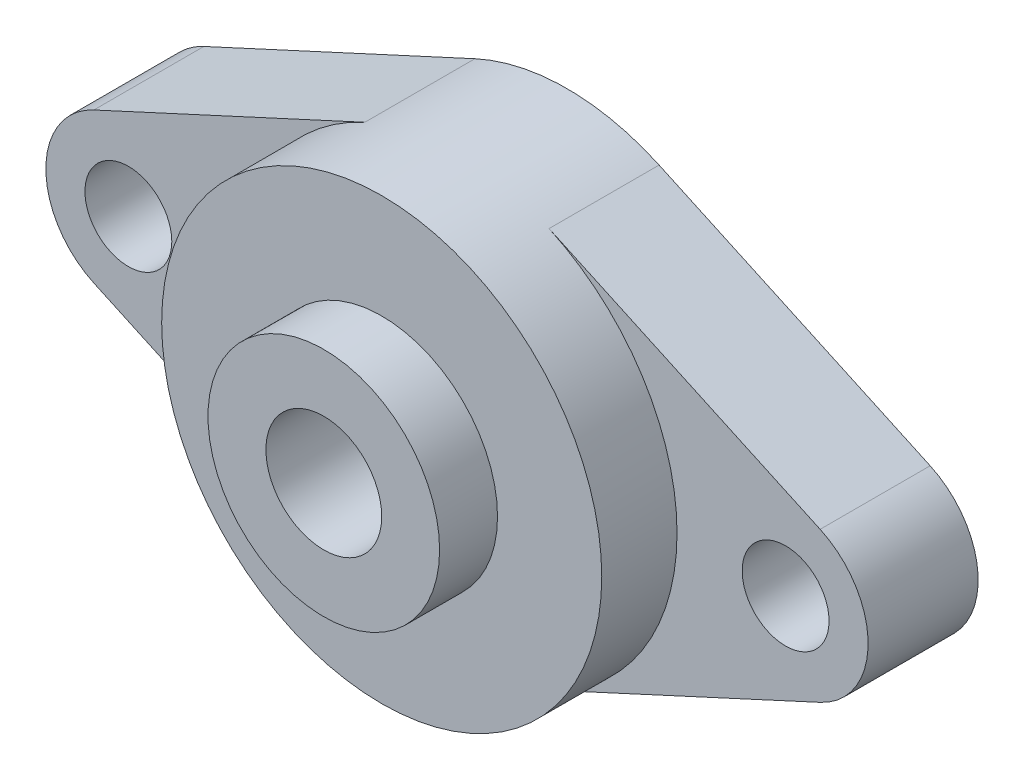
from build123d import *

# Parameters (mm, degrees)
BOSS_EXTRUDE1_DEPTH              = 15.08125
BOSS_EXTRUDE2_START              = 10.31875
SKETCH4_R                        = 30.1625
BOSS_EXTRUDE2_DEPTH              = 10.31875
SKETCH5_R                        = 15.875
BOSS_EXTRUDE3_DEPTH              = 7.9375
F_5_8_0_625_DIAMETER_HOLE1_D     = 15.875
F_15_32_0_46875_DIAMETER_HOLE1_D = 11.90625


with BuildPart() as part:
    # Sketch1 → Boss-Extrude1 (new body)
    with BuildSketch(Plane.XY):
        with BuildLine():
            Line((-12.623072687, 27.39405852), (-49.778964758, 10.272771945))
            ThreePointArc((-49.778964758, 10.272771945), (-56.35625, 0), (-49.778964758, -10.272771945))
            Line((-49.778964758, -10.272771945), (-12.623072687, -27.39405852))
            ThreePointArc((-12.623072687, -27.39405852), (0, -30.1625), (12.623072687, -27.39405852))
            Line((12.623072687, -27.39405852), (49.778964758, -10.272771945))
            ThreePointArc((49.778964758, -10.272771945), (56.35625, 0), (49.778964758, 10.272771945))
            Line((49.778964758, 10.272771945), (12.623072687, 27.39405852))
            ThreePointArc((12.623072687, 27.39405852), (0, 30.1625), (-12.623072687, 27.39405852))
        make_face()
    extrude(amount=-BOSS_EXTRUDE1_DEPTH)

    # Sketch4 → Boss-Extrude2 (add)
    with BuildSketch(Plane.XY.offset(BOSS_EXTRUDE2_START)):
        Circle(SKETCH4_R)
    extrude(amount=-BOSS_EXTRUDE2_DEPTH)

    # Sketch5 → Boss-Extrude3 (add)
    with BuildSketch(Plane.XY.offset(10.31875)):
        Circle(SKETCH5_R)
    extrude(amount=BOSS_EXTRUDE3_DEPTH)

    # 5_8 _0.625_ Diameter Hole1 (through all)
    with Locations(Plane.XY.offset(18.25625)):
        with Locations((0, 0)):
            Hole(F_5_8_0_625_DIAMETER_HOLE1_D / 2)

    # 15_32 _0.46875_ Diameter Hole1 (through all)
    with Locations(Plane.XY):
        with Locations((-45.0453125, 0), (45.0453125, 0)):
            Hole(F_15_32_0_46875_DIAMETER_HOLE1_D / 2)


solid = part.part
